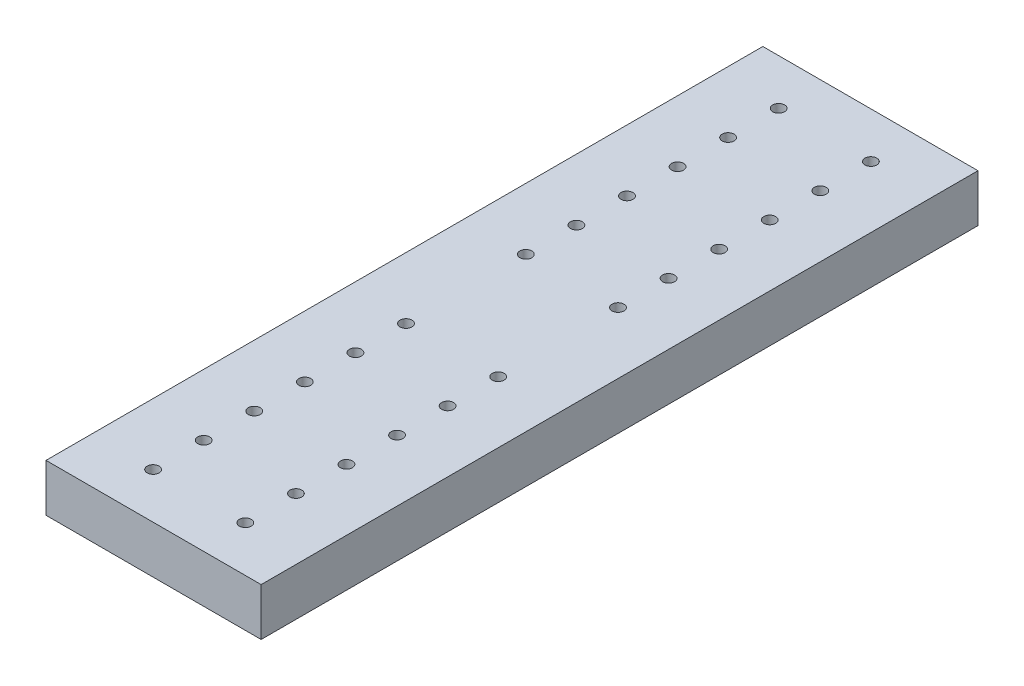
from build123d import *

# Parameters (mm, degrees)
SKETCH1_W           = 1148.588
SKETCH1_H           = 3827.05
BOSS_EXTRUDE1_DEPTH = 254
SKETCH5_R           = 31.75
CUT_EXTRUDE1_DEPTH  = 2014.928381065


with BuildPart() as part:
    # Sketch1 → Boss-Extrude1 (new body)
    with BuildSketch(Plane(origin=(0, 0, 0), x_dir=(-1, 0, 0), z_dir=(0, 1, 0))):
        Rectangle(SKETCH1_W, SKETCH1_H)
    extrude(amount=BOSS_EXTRUDE1_DEPTH)

    # Sketch5 → Cut-Extrude1 (cut, through all)
    with BuildSketch(Plane(origin=(0, 0, 0), x_dir=(-1, 0, 0), z_dir=(0, 1, 0))):
        with Locations(Location((-246.0625, 1669.8625, 0), (0, 0, 90))):
            Circle(SKETCH5_R)
        with Locations(Location((246.0625, 1669.8625, 0), (0, 0, 90))):
            Circle(SKETCH5_R)
        with Locations(Location((-246.0625, -319.8625, 0), (0, 0, 90))):
            Circle(SKETCH5_R)
        with Locations(Location((246.0625, -319.8625, 0), (0, 0, 90))):
            Circle(SKETCH5_R)
        with Locations(Location((-246.0625, 1399.8625, 0), (0, 0, 90))):
            Circle(SKETCH5_R)
        with Locations(Location((246.0625, 1399.8625, 0), (0, 0, 90))):
            Circle(SKETCH5_R)
        with Locations(Location((-246.0625, -589.8625, 0), (0, 0, 90))):
            Circle(SKETCH5_R)
        with Locations(Location((246.0625, -589.8625, 0), (0, 0, 90))):
            Circle(SKETCH5_R)
        with Locations(Location((-246.0625, 1129.8625, 0), (0, 0, 90))):
            Circle(SKETCH5_R)
        with Locations(Location((246.0625, 1129.8625, 0), (0, 0, 90))):
            Circle(SKETCH5_R)
        with Locations(Location((-246.0625, -859.8625, 0), (0, 0, 90))):
            Circle(SKETCH5_R)
        with Locations(Location((246.0625, -859.8625, 0), (0, 0, 90))):
            Circle(SKETCH5_R)
        with Locations(Location((-246.0625, 859.8625, 0), (0, 0, 90))):
            Circle(SKETCH5_R)
        with Locations(Location((246.0625, 859.8625, 0), (0, 0, 90))):
            Circle(SKETCH5_R)
        with Locations(Location((-246.0625, -1129.8625, 0), (0, 0, 90))):
            Circle(SKETCH5_R)
        with Locations(Location((246.0625, -1129.8625, 0), (0, 0, 90))):
            Circle(SKETCH5_R)
        with Locations(Location((-246.0625, 589.8625, 0), (0, 0, 90))):
            Circle(SKETCH5_R)
        with Locations(Location((246.0625, 589.8625, 0), (0, 0, 90))):
            Circle(SKETCH5_R)
        with Locations(Location((-246.0625, -1399.8625, 0), (0, 0, 90))):
            Circle(SKETCH5_R)
        with Locations(Location((246.0625, -1399.8625, 0), (0, 0, 90))):
            Circle(SKETCH5_R)
        with Locations(Location((-246.0625, 319.8625, 0), (0, 0, 90))):
            Circle(SKETCH5_R)
        with Locations(Location((246.0625, 319.8625, 0), (0, 0, 90))):
            Circle(SKETCH5_R)
        with Locations(Location((-246.0625, -1669.8625, 0), (0, 0, 90))):
            Circle(SKETCH5_R)
        with Locations(Location((246.0625, -1669.8625, 0), (0, 0, 90))):
            Circle(SKETCH5_R)
    extrude(amount=CUT_EXTRUDE1_DEPTH, mode=Mode.SUBTRACT)


solid = part.part
